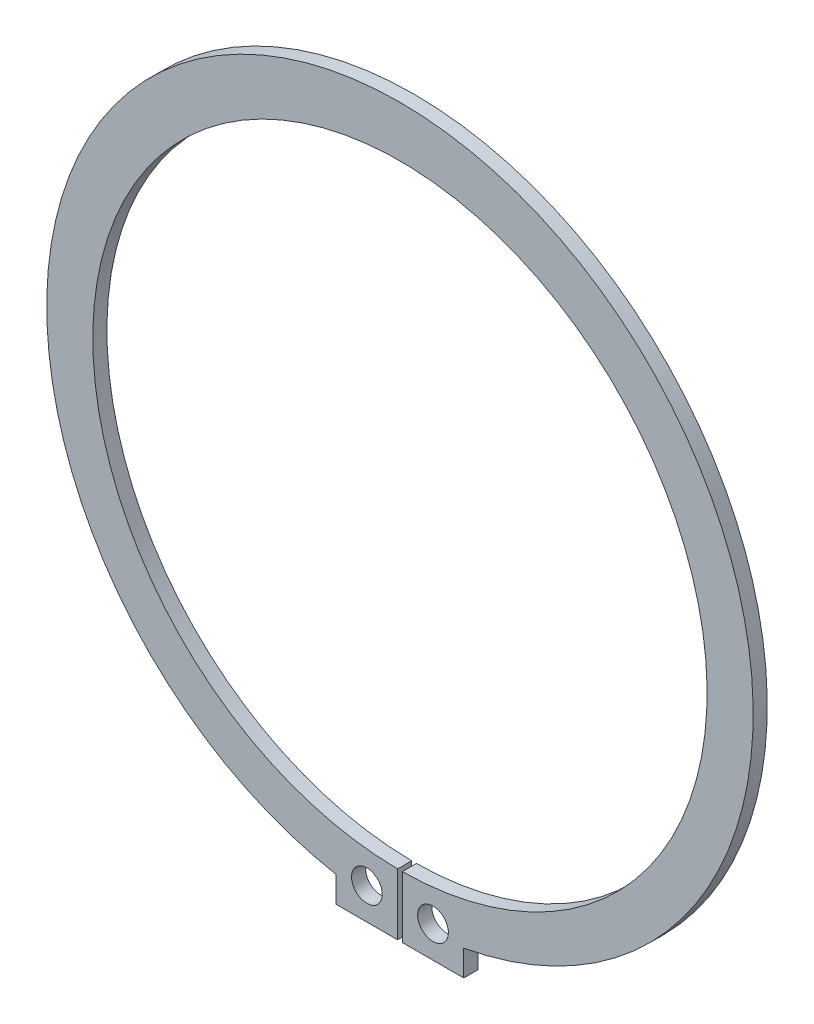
from build123d import *

# Parameters (mm, degrees)
ESQUISSE1_R             = 28.06
PAISSEUR_DEPTH          = 1.12
ESQUISSE2_R             = 24.4
DIAM_INT_DEPTH          = 40.698634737
FENTE_DEPTH             = 40.698634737
BOSS_DEPTH              = 1.12
ESQUISSE5_R             = 1.22
ENL_V_MAT_EXTRU_1_DEPTH = 41.839880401


with BuildPart() as part:
    # Esquisse1 → paisseur (new body)
    with BuildSketch(Plane.XY):
        Circle(ESQUISSE1_R)
    extrude(amount=PAISSEUR_DEPTH)

    # Esquisse2 → diam int (cut, through all)
    with BuildSketch(Plane.XY.offset(1.12)):
        with Locations((0, -0.373333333)):
            Circle(ESQUISSE2_R)
    extrude(amount=-DIAM_INT_DEPTH, mode=Mode.SUBTRACT)

    # Esquisse3 → fente (cut, through all)
    with BuildSketch(Plane.XY.offset(1.12)):
        with BuildLine():
            Line((-0.186666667, -24.772619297), (-0.186666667, -28.059379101))
            ThreePointArc((-0.186666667, -28.059379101), (0, -28.06), (0.186666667, -28.059379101))
            Line((0.186666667, -28.059379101), (0.186666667, -24.772619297))
            ThreePointArc((0.186666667, -24.772619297), (0, -24.773333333), (-0.186666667, -24.772619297))
        make_face()
    extrude(amount=-FENTE_DEPTH, mode=Mode.SUBTRACT)

    # Esquisse4 → Boss (add)
    with BuildSketch(Plane.XY.offset(1.12)):
        with BuildLine():
            Line((0.186666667, -24.772619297), (0.186666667, -29.652619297))
            Line((0.186666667, -29.652619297), (5.066666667, -29.652619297))
            Line((5.066666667, -29.652619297), (5.066666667, -24.241489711))
            ThreePointArc((5.066666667, -24.241489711), (2.640057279, -24.630086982), (0.186666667, -24.772619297))
        make_face()
        with BuildLine():
            Line((-5.066666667, -29.652619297), (-5.066666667, -24.241489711))
            ThreePointArc((-5.066666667, -24.241489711), (-2.640057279, -24.630086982), (-0.186666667, -24.772619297))
            Line((-0.186666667, -24.772619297), (-0.186666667, -29.652619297))
            Line((-0.186666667, -29.652619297), (-5.066666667, -29.652619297))
        make_face()
    extrude(amount=-BOSS_DEPTH)

    # Esquisse5 → Enl_v. mat.-Extru.1 (cut, through all)
    with BuildSketch(Plane.XY.offset(1.12)):
        with Locations((-2.626666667, -27.142079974)):
            Circle(ESQUISSE5_R)
        with Locations(Location((2.626666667, -27.142079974, 0), (0, 0, 180))):
            Circle(ESQUISSE5_R)
    extrude(amount=-ENL_V_MAT_EXTRU_1_DEPTH, mode=Mode.SUBTRACT)


solid = part.part
